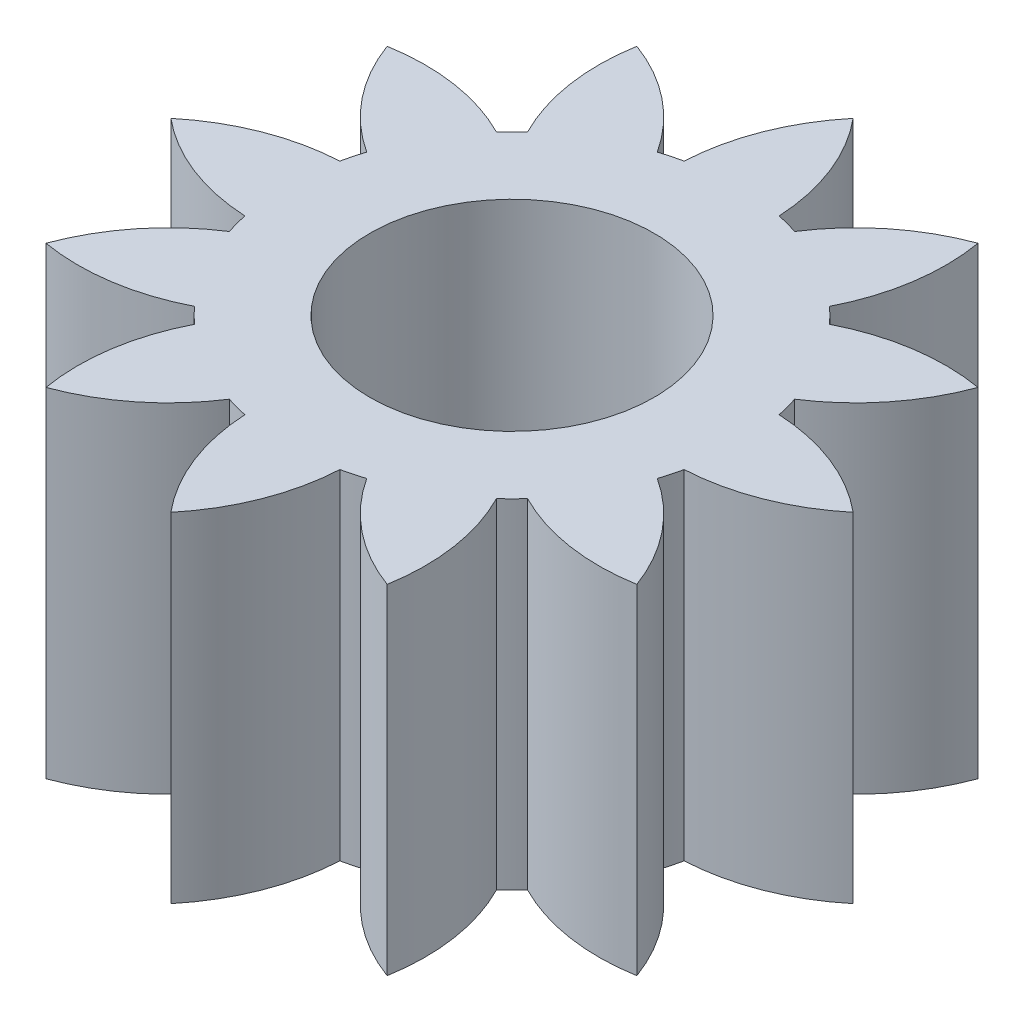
from build123d import *

# Parameters (mm, degrees)
SKETCH1_R           = 3.8735
SKETCH1_R_2         = 2.4511
BOSS_EXTRUDE1_DEPTH = 5.842
BOSS_EXTRUDE2_DEPTH = 5.842


with BuildPart() as part:
    # Sketch1 → Boss-Extrude1 (new body)
    with BuildSketch(Plane(origin=(0, 0, 0), x_dir=(1, 0, 0), z_dir=(0, 1, 0))):
        with Locations(Location((0, 0, 0), (0, 0, 270))):
            Circle(SKETCH1_R)
        with Locations(Location((0, 0, 0), (0, 0, 270))):
            Circle(SKETCH1_R_2, mode=Mode.SUBTRACT)
    extrude(amount=BOSS_EXTRUDE1_DEPTH)

    # Sketch2 → Boss-Extrude2 (add)
    with BuildSketch(Plane(origin=(0, 0, 0), x_dir=(1, 0, 0), z_dir=(0, 1, 0))):
        with BuildLine():
            ThreePointArc((0, 5.8801), (-0.579014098, 4.899460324), (-0.818335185, 3.786070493))
            ThreePointArc((-0.818335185, 3.786070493), (0, 3.8735), (0.818335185, 3.786070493))
            ThreePointArc((0.818335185, 3.786070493), (0.579014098, 4.899460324), (0, 5.8801))
        make_face()
        with BuildLine():
            ThreePointArc((1.184336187, 3.68800082), (1.93675, 3.354549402), (2.601734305, 2.869665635))
            ThreePointArc((2.601734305, 2.869665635), (2.951171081, 3.953550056), (2.94005, 5.092315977))
            ThreePointArc((2.94005, 5.092315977), (1.948289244, 4.532564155), (1.184336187, 3.68800082))
        make_face()
        with BuildLine():
            ThreePointArc((2.869665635, 2.601734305), (3.354549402, 1.93675), (3.68800082, 1.184336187))
            ThreePointArc((3.68800082, 1.184336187), (4.532564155, 1.948289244), (5.092315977, 2.94005))
            ThreePointArc((5.092315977, 2.94005), (3.953550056, 2.951171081), (2.869665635, 2.601734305))
        make_face()
        with BuildLine():
            ThreePointArc((3.786070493, 0.818335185), (3.8735, 0), (3.786070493, -0.818335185))
            ThreePointArc((3.786070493, -0.818335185), (4.899460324, -0.579014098), (5.8801, 0))
            ThreePointArc((5.8801, 0), (4.899460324, 0.579014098), (3.786070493, 0.818335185))
        make_face()
        with BuildLine():
            ThreePointArc((3.68800082, -1.184336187), (3.354549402, -1.93675), (2.869665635, -2.601734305))
            ThreePointArc((2.869665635, -2.601734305), (3.953550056, -2.951171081), (5.092315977, -2.94005))
            ThreePointArc((5.092315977, -2.94005), (4.532564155, -1.948289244), (3.68800082, -1.184336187))
        make_face()
        with BuildLine():
            ThreePointArc((2.601734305, -2.869665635), (1.93675, -3.354549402), (1.184336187, -3.68800082))
            ThreePointArc((1.184336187, -3.68800082), (1.948289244, -4.532564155), (2.94005, -5.092315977))
            ThreePointArc((2.94005, -5.092315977), (2.951171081, -3.953550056), (2.601734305, -2.869665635))
        make_face()
        with BuildLine():
            ThreePointArc((0.818335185, -3.786070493), (0, -3.8735), (-0.818335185, -3.786070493))
            ThreePointArc((-0.818335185, -3.786070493), (-0.579014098, -4.899460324), (0, -5.8801))
            ThreePointArc((0, -5.8801), (0.579014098, -4.899460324), (0.818335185, -3.786070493))
        make_face()
        with BuildLine():
            ThreePointArc((-1.184336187, -3.68800082), (-1.93675, -3.354549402), (-2.601734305, -2.869665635))
            ThreePointArc((-2.601734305, -2.869665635), (-2.951171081, -3.953550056), (-2.94005, -5.092315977))
            ThreePointArc((-2.94005, -5.092315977), (-1.948289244, -4.532564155), (-1.184336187, -3.68800082))
        make_face()
        with BuildLine():
            ThreePointArc((-2.869665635, -2.601734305), (-3.354549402, -1.93675), (-3.68800082, -1.184336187))
            ThreePointArc((-3.68800082, -1.184336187), (-4.532564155, -1.948289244), (-5.092315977, -2.94005))
            ThreePointArc((-5.092315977, -2.94005), (-3.953550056, -2.951171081), (-2.869665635, -2.601734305))
        make_face()
        with BuildLine():
            ThreePointArc((-3.786070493, -0.818335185), (-3.8735, 0), (-3.786070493, 0.818335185))
            ThreePointArc((-3.786070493, 0.818335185), (-4.899460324, 0.579014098), (-5.8801, 0))
            ThreePointArc((-5.8801, 0), (-4.899460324, -0.579014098), (-3.786070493, -0.818335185))
        make_face()
        with BuildLine():
            ThreePointArc((-3.68800082, 1.184336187), (-3.354549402, 1.93675), (-2.869665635, 2.601734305))
            ThreePointArc((-2.869665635, 2.601734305), (-3.953550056, 2.951171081), (-5.092315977, 2.94005))
            ThreePointArc((-5.092315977, 2.94005), (-4.532564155, 1.948289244), (-3.68800082, 1.184336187))
        make_face()
        with BuildLine():
            ThreePointArc((-2.601734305, 2.869665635), (-1.93675, 3.354549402), (-1.184336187, 3.68800082))
            ThreePointArc((-1.184336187, 3.68800082), (-1.948289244, 4.532564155), (-2.94005, 5.092315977))
            ThreePointArc((-2.94005, 5.092315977), (-2.951171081, 3.953550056), (-2.601734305, 2.869665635))
        make_face()
    extrude(amount=BOSS_EXTRUDE2_DEPTH)


solid = part.part
